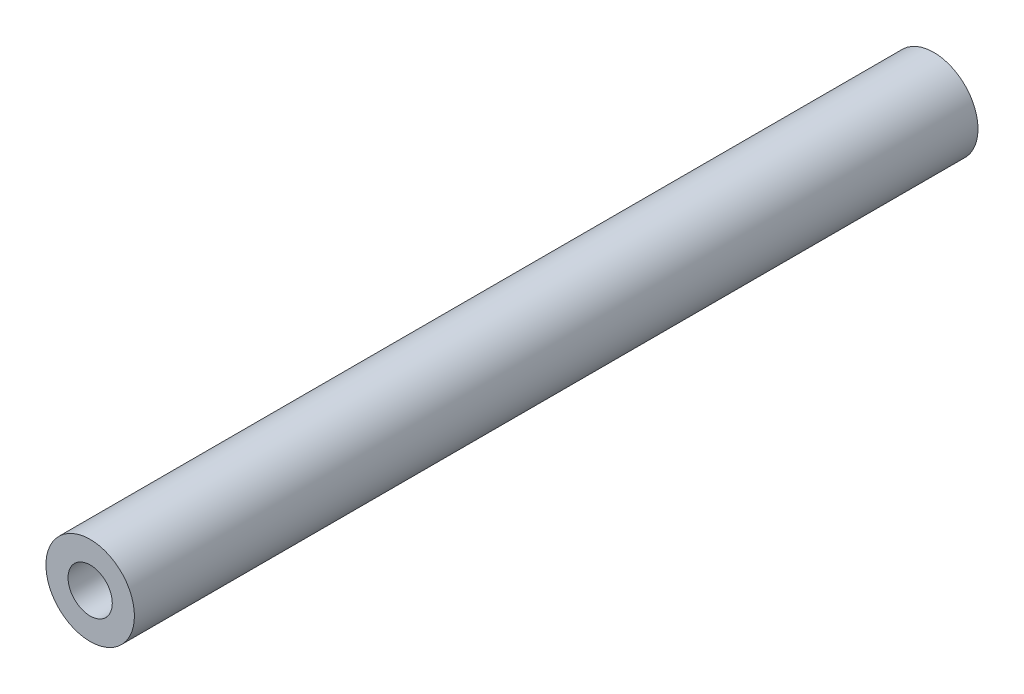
ISO-10303-21;
HEADER;
FILE_DESCRIPTION(('STEP AP214'),'2;1');
FILE_NAME('part.step','',(''),(''),'','','');
FILE_SCHEMA(('AUTOMOTIVE_DESIGN { 1 0 10303 214 1 1 1 1 }'));
ENDSEC;
DATA;
#1=APPLICATION_CONTEXT('core data for automotive mechanical design processes');
#2=APPLICATION_PROTOCOL_DEFINITION('international standard','automotive_design',2000,#1);
#3=PRODUCT_CONTEXT('',#1,'mechanical');
#4=PRODUCT('Part','Part','',(#3));
#5=PRODUCT_RELATED_PRODUCT_CATEGORY('part','',(#4));
#6=PRODUCT_DEFINITION_FORMATION('','',#4);
#7=PRODUCT_DEFINITION_CONTEXT('part definition',#1,'design');
#8=PRODUCT_DEFINITION('design','',#6,#7);
#9=PRODUCT_DEFINITION_SHAPE('','',#8);
#10=(LENGTH_UNIT() NAMED_UNIT(*) SI_UNIT(.MILLI.,.METRE.));
#11=(NAMED_UNIT(*) PLANE_ANGLE_UNIT() SI_UNIT($,.RADIAN.));
#12=(NAMED_UNIT(*) SI_UNIT($,.STERADIAN.) SOLID_ANGLE_UNIT());
#13=UNCERTAINTY_MEASURE_WITH_UNIT(LENGTH_MEASURE(1.E-05),#10,'distance_accuracy_value','');
#14=(GEOMETRIC_REPRESENTATION_CONTEXT(3) GLOBAL_UNCERTAINTY_ASSIGNED_CONTEXT((#13)) GLOBAL_UNIT_ASSIGNED_CONTEXT((#10,
#11,#12)) REPRESENTATION_CONTEXT('',''));
#15=CARTESIAN_POINT('',(0.,0.,0.));
#16=DIRECTION('',(0.,0.,1.));
#17=DIRECTION('',(1.,0.,0.));
#18=AXIS2_PLACEMENT_3D('',#15,#16,#17);
#19=CARTESIAN_POINT('',(0.,0.,305.));
#20=DIRECTION('',(0.,0.,1.));
#21=DIRECTION('',(1.,0.,0.));
#22=AXIS2_PLACEMENT_3D('',#19,#20,#21);
#23=PLANE('',#22);
#24=CARTESIAN_POINT('',(0.,0.,305.));
#25=DIRECTION('',(0.,0.,1.));
#26=DIRECTION('',(1.,0.,0.));
#27=AXIS2_PLACEMENT_3D('',#24,#25,#26);
#28=CIRCLE('',#27,16.);
#29=CARTESIAN_POINT('',(16.,0.,305.));
#30=VERTEX_POINT('',#29);
#31=EDGE_CURVE('E9',#30,#30,#28,.T.);
#32=ORIENTED_EDGE('',*,*,#31,.T.);
#33=EDGE_LOOP('',(#32));
#34=FACE_BOUND('',#33,.T.);
#35=CARTESIAN_POINT('',(0.,0.,305.));
#36=DIRECTION('',(0.,0.,1.));
#37=DIRECTION('',(1.,0.,0.));
#38=AXIS2_PLACEMENT_3D('',#35,#36,#37);
#39=CIRCLE('',#38,8.);
#40=CARTESIAN_POINT('',(8.,0.,305.));
#41=VERTEX_POINT('',#40);
#42=EDGE_CURVE('E25',#41,#41,#39,.T.);
#43=ORIENTED_EDGE('',*,*,#42,.F.);
#44=EDGE_LOOP('',(#43));
#45=FACE_BOUND('',#44,.T.);
#46=ADVANCED_FACE('F14',(#34,#45),#23,.T.);
#47=CARTESIAN_POINT('',(0.,0.,0.));
#48=DIRECTION('',(0.,0.,1.));
#49=DIRECTION('',(1.,0.,0.));
#50=AXIS2_PLACEMENT_3D('',#47,#48,#49);
#51=PLANE('',#50);
#52=CARTESIAN_POINT('',(0.,0.,0.));
#53=DIRECTION('',(0.,0.,1.));
#54=DIRECTION('',(1.,0.,0.));
#55=AXIS2_PLACEMENT_3D('',#52,#53,#54);
#56=CIRCLE('',#55,16.);
#57=CARTESIAN_POINT('',(16.,0.,0.));
#58=VERTEX_POINT('',#57);
#59=EDGE_CURVE('E18',#58,#58,#56,.T.);
#60=ORIENTED_EDGE('',*,*,#59,.F.);
#61=EDGE_LOOP('',(#60));
#62=FACE_BOUND('',#61,.T.);
#63=CARTESIAN_POINT('',(0.,0.,0.));
#64=DIRECTION('',(0.,0.,1.));
#65=DIRECTION('',(1.,0.,0.));
#66=AXIS2_PLACEMENT_3D('',#63,#64,#65);
#67=CIRCLE('',#66,8.);
#68=CARTESIAN_POINT('',(8.,0.,0.));
#69=VERTEX_POINT('',#68);
#70=EDGE_CURVE('E27',#69,#69,#67,.T.);
#71=ORIENTED_EDGE('',*,*,#70,.T.);
#72=EDGE_LOOP('',(#71));
#73=FACE_BOUND('',#72,.T.);
#74=ADVANCED_FACE('F37',(#62,#73),#51,.F.);
#75=CARTESIAN_POINT('',(0.,0.,305.));
#76=DIRECTION('',(0.,0.,-1.));
#77=DIRECTION('',(-1.,0.,0.));
#78=AXIS2_PLACEMENT_3D('',#75,#76,#77);
#79=CYLINDRICAL_SURFACE('',#78,16.);
#80=ORIENTED_EDGE('',*,*,#31,.F.);
#81=EDGE_LOOP('',(#80));
#82=FACE_BOUND('',#81,.T.);
#83=ORIENTED_EDGE('',*,*,#59,.T.);
#84=EDGE_LOOP('',(#83));
#85=FACE_BOUND('',#84,.T.);
#86=ADVANCED_FACE('F16',(#82,#85),#79,.T.);
#87=CARTESIAN_POINT('',(0.,0.,305.));
#88=DIRECTION('',(0.,0.,-1.));
#89=DIRECTION('',(-1.,0.,0.));
#90=AXIS2_PLACEMENT_3D('',#87,#88,#89);
#91=CYLINDRICAL_SURFACE('',#90,8.);
#92=ORIENTED_EDGE('',*,*,#42,.T.);
#93=EDGE_LOOP('',(#92));
#94=FACE_BOUND('',#93,.T.);
#95=ORIENTED_EDGE('',*,*,#70,.F.);
#96=EDGE_LOOP('',(#95));
#97=FACE_BOUND('',#96,.T.);
#98=ADVANCED_FACE('F33',(#94,#97),#91,.F.);
#99=CLOSED_SHELL('',(#46,#74,#86,#98));
#100=MANIFOLD_SOLID_BREP('B1',#99);
#101=ADVANCED_BREP_SHAPE_REPRESENTATION('',(#18,#100),#14);
#102=SHAPE_DEFINITION_REPRESENTATION(#9,#101);
ENDSEC;
END-ISO-10303-21;
